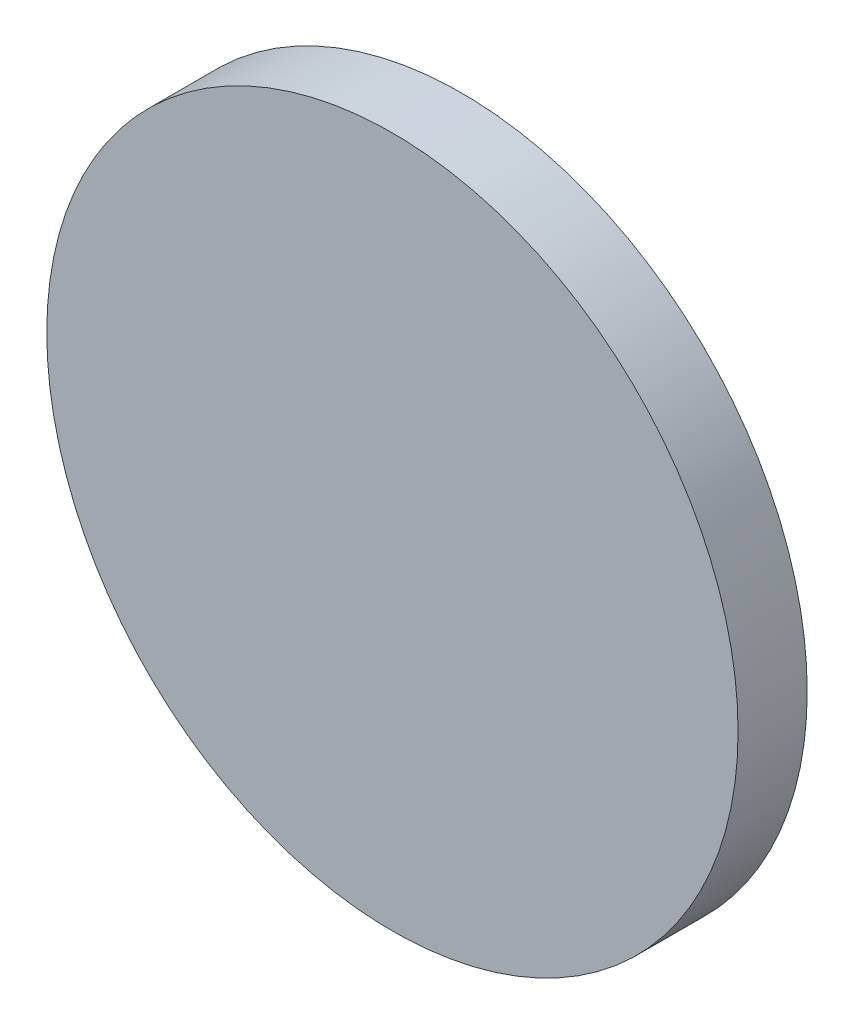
from build123d import *

# Parameters (mm, degrees)
ESQUISSE1_R        = 50
BOSS_EXTRU_1_DEPTH = 10


with BuildPart() as part:
    # Esquisse1 → Boss.-Extru.1 (new body)
    with BuildSketch(Plane.XY):
        Circle(ESQUISSE1_R)
    extrude(amount=BOSS_EXTRU_1_DEPTH)


solid = part.part
